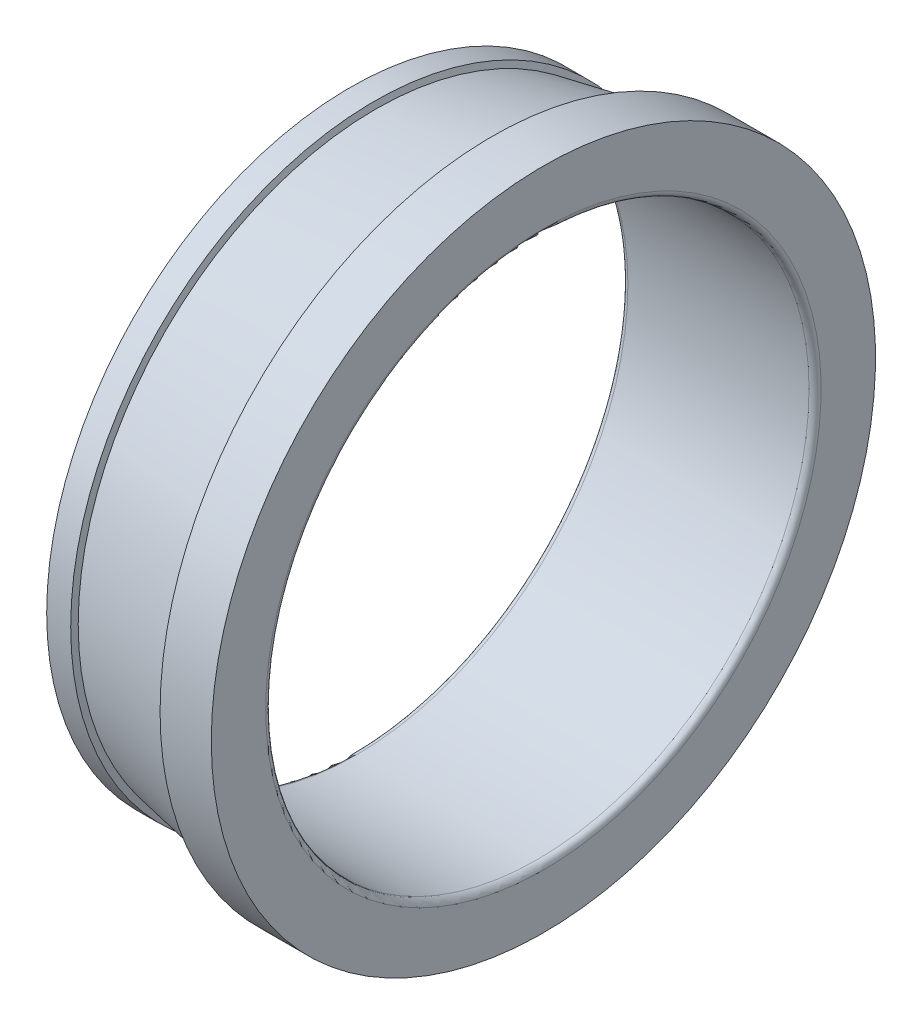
ISO-10303-21;
HEADER;
FILE_DESCRIPTION(('STEP AP214'),'2;1');
FILE_NAME('part.step','',(''),(''),'','','');
FILE_SCHEMA(('AUTOMOTIVE_DESIGN { 1 0 10303 214 1 1 1 1 }'));
ENDSEC;
DATA;
#1=APPLICATION_CONTEXT('core data for automotive mechanical design processes');
#2=APPLICATION_PROTOCOL_DEFINITION('international standard','automotive_design',2000,#1);
#3=PRODUCT_CONTEXT('',#1,'mechanical');
#4=PRODUCT('Part','Part','',(#3));
#5=PRODUCT_RELATED_PRODUCT_CATEGORY('part','',(#4));
#6=PRODUCT_DEFINITION_FORMATION('','',#4);
#7=PRODUCT_DEFINITION_CONTEXT('part definition',#1,'design');
#8=PRODUCT_DEFINITION('design','',#6,#7);
#9=PRODUCT_DEFINITION_SHAPE('','',#8);
#10=(LENGTH_UNIT() NAMED_UNIT(*) SI_UNIT(.MILLI.,.METRE.));
#11=(NAMED_UNIT(*) PLANE_ANGLE_UNIT() SI_UNIT($,.RADIAN.));
#12=(NAMED_UNIT(*) SI_UNIT($,.STERADIAN.) SOLID_ANGLE_UNIT());
#13=UNCERTAINTY_MEASURE_WITH_UNIT(LENGTH_MEASURE(1.E-05),#10,'distance_accuracy_value','');
#14=(GEOMETRIC_REPRESENTATION_CONTEXT(3) GLOBAL_UNCERTAINTY_ASSIGNED_CONTEXT((#13)) GLOBAL_UNIT_ASSIGNED_CONTEXT((#10,
#11,#12)) REPRESENTATION_CONTEXT('',''));
#15=CARTESIAN_POINT('',(0.,0.,0.));
#16=DIRECTION('',(0.,0.,1.));
#17=DIRECTION('',(1.,0.,0.));
#18=AXIS2_PLACEMENT_3D('',#15,#16,#17);
#19=CARTESIAN_POINT('',(1.,0.,0.));
#20=DIRECTION('',(-1.,0.,0.));
#21=DIRECTION('',(0.,0.,1.));
#22=AXIS2_PLACEMENT_3D('',#19,#20,#21);
#23=TOROIDAL_SURFACE('',#22,46.,1.);
#24=CARTESIAN_POINT('',(1.,0.,0.));
#25=DIRECTION('',(-1.,0.,0.));
#26=DIRECTION('',(0.,0.,1.));
#27=AXIS2_PLACEMENT_3D('',#24,#25,#26);
#28=CIRCLE('',#27,45.);
#29=CARTESIAN_POINT('',(1.,0.,45.));
#30=VERTEX_POINT('',#29);
#31=EDGE_CURVE('E10',#30,#30,#28,.T.);
#32=ORIENTED_EDGE('',*,*,#31,.F.);
#33=EDGE_LOOP('',(#32));
#34=FACE_BOUND('',#33,.T.);
#35=CARTESIAN_POINT('',(0.,0.,0.));
#36=DIRECTION('',(-1.,0.,0.));
#37=DIRECTION('',(0.,0.,1.));
#38=AXIS2_PLACEMENT_3D('',#35,#36,#37);
#39=CIRCLE('',#38,46.);
#40=CARTESIAN_POINT('',(0.,0.,46.));
#41=VERTEX_POINT('',#40);
#42=EDGE_CURVE('E63',#41,#41,#39,.T.);
#43=ORIENTED_EDGE('',*,*,#42,.T.);
#44=EDGE_LOOP('',(#43));
#45=FACE_BOUND('',#44,.T.);
#46=ADVANCED_FACE('F29',(#34,#45),#23,.T.);
#47=CARTESIAN_POINT('',(0.,0.,0.));
#48=DIRECTION('',(-1.,0.,0.));
#49=DIRECTION('',(0.,0.,1.));
#50=AXIS2_PLACEMENT_3D('',#47,#48,#49);
#51=CYLINDRICAL_SURFACE('',#50,45.);
#52=CARTESIAN_POINT('',(31.,0.,0.));
#53=DIRECTION('',(-1.,0.,0.));
#54=DIRECTION('',(0.,0.,1.));
#55=AXIS2_PLACEMENT_3D('',#52,#53,#54);
#56=CIRCLE('',#55,45.);
#57=CARTESIAN_POINT('',(31.,0.,45.));
#58=VERTEX_POINT('',#57);
#59=EDGE_CURVE('E35',#58,#58,#56,.T.);
#60=ORIENTED_EDGE('',*,*,#59,.F.);
#61=EDGE_LOOP('',(#60));
#62=FACE_BOUND('',#61,.T.);
#63=ORIENTED_EDGE('',*,*,#31,.T.);
#64=EDGE_LOOP('',(#63));
#65=FACE_BOUND('',#64,.T.);
#66=ADVANCED_FACE('F112',(#62,#65),#51,.F.);
#67=CARTESIAN_POINT('',(31.,0.,0.));
#68=DIRECTION('',(-1.,0.,0.));
#69=DIRECTION('',(0.,0.,1.));
#70=AXIS2_PLACEMENT_3D('',#67,#68,#69);
#71=TOROIDAL_SURFACE('',#70,46.,1.);
#72=CARTESIAN_POINT('',(32.,0.,0.));
#73=DIRECTION('',(-1.,0.,0.));
#74=DIRECTION('',(0.,0.,1.));
#75=AXIS2_PLACEMENT_3D('',#72,#73,#74);
#76=CIRCLE('',#75,46.);
#77=CARTESIAN_POINT('',(32.,0.,46.));
#78=VERTEX_POINT('',#77);
#79=EDGE_CURVE('E39',#78,#78,#76,.T.);
#80=ORIENTED_EDGE('',*,*,#79,.F.);
#81=EDGE_LOOP('',(#80));
#82=FACE_BOUND('',#81,.T.);
#83=ORIENTED_EDGE('',*,*,#59,.T.);
#84=EDGE_LOOP('',(#83));
#85=FACE_BOUND('',#84,.T.);
#86=ADVANCED_FACE('F107',(#82,#85),#71,.T.);
#87=CARTESIAN_POINT('',(32.,0.,-55.0152379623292));
#88=DIRECTION('',(-1.,0.,0.));
#89=DIRECTION('',(0.,0.,1.));
#90=AXIS2_PLACEMENT_3D('',#87,#88,#89);
#91=PLANE('',#90);
#92=CARTESIAN_POINT('',(32.,0.,0.));
#93=DIRECTION('',(-1.,0.,0.));
#94=DIRECTION('',(0.,0.,1.));
#95=AXIS2_PLACEMENT_3D('',#92,#93,#94);
#96=CIRCLE('',#95,55.0152379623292);
#97=CARTESIAN_POINT('',(32.,0.,55.0152379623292));
#98=VERTEX_POINT('',#97);
#99=EDGE_CURVE('E43',#98,#98,#96,.T.);
#100=ORIENTED_EDGE('',*,*,#99,.F.);
#101=EDGE_LOOP('',(#100));
#102=FACE_BOUND('',#101,.T.);
#103=ORIENTED_EDGE('',*,*,#79,.T.);
#104=EDGE_LOOP('',(#103));
#105=FACE_BOUND('',#104,.T.);
#106=ADVANCED_FACE('F101',(#102,#105),#91,.F.);
#107=CARTESIAN_POINT('',(0.,0.,0.));
#108=DIRECTION('',(-1.,0.,0.));
#109=DIRECTION('',(0.,0.,1.));
#110=AXIS2_PLACEMENT_3D('',#107,#108,#109);
#111=CYLINDRICAL_SURFACE('',#110,55.0152379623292);
#112=CARTESIAN_POINT('',(23.5130434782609,0.,0.));
#113=DIRECTION('',(-1.,0.,0.));
#114=DIRECTION('',(0.,0.,1.));
#115=AXIS2_PLACEMENT_3D('',#112,#113,#114);
#116=CIRCLE('',#115,55.0152379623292);
#117=CARTESIAN_POINT('',(23.5130434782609,0.,55.0152379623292));
#118=VERTEX_POINT('',#117);
#119=EDGE_CURVE('E48',#118,#118,#116,.T.);
#120=ORIENTED_EDGE('',*,*,#119,.F.);
#121=EDGE_LOOP('',(#120));
#122=FACE_BOUND('',#121,.T.);
#123=ORIENTED_EDGE('',*,*,#99,.T.);
#124=EDGE_LOOP('',(#123));
#125=FACE_BOUND('',#124,.T.);
#126=ADVANCED_FACE('F95',(#122,#125),#111,.T.);
#127=CARTESIAN_POINT('',(23.5130434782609,0.,0.));
#128=DIRECTION('',(-1.,0.,0.));
#129=DIRECTION('',(0.,0.,1.));
#130=AXIS2_PLACEMENT_3D('',#127,#128,#129);
#131=CONICAL_SURFACE('',#130,55.0152379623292,1.33196512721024);
#132=CARTESIAN_POINT('',(24.,0.,0.));
#133=DIRECTION('',(-1.,0.,0.));
#134=DIRECTION('',(0.,0.,1.));
#135=AXIS2_PLACEMENT_3D('',#132,#133,#134);
#136=CIRCLE('',#135,53.0152379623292);
#137=CARTESIAN_POINT('',(24.,0.,53.0152379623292));
#138=VERTEX_POINT('',#137);
#139=EDGE_CURVE('E51',#138,#138,#136,.T.);
#140=ORIENTED_EDGE('',*,*,#139,.F.);
#141=EDGE_LOOP('',(#140));
#142=FACE_BOUND('',#141,.T.);
#143=ORIENTED_EDGE('',*,*,#119,.T.);
#144=EDGE_LOOP('',(#143));
#145=FACE_BOUND('',#144,.T.);
#146=ADVANCED_FACE('F89',(#142,#145),#131,.F.);
#147=CARTESIAN_POINT('',(24.,0.,0.));
#148=DIRECTION('',(1.,0.,0.));
#149=DIRECTION('',(0.,0.,-1.));
#150=AXIS2_PLACEMENT_3D('',#147,#148,#149);
#151=CONICAL_SURFACE('',#150,53.0152379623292,0.186471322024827);
#152=CARTESIAN_POINT('',(4.22482411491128,0.,0.));
#153=DIRECTION('',(-1.,0.,0.));
#154=DIRECTION('',(0.,0.,1.));
#155=AXIS2_PLACEMENT_3D('',#152,#153,#154);
#156=CIRCLE('',#155,49.2843917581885);
#157=CARTESIAN_POINT('',(4.22482411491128,0.,49.2843917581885));
#158=VERTEX_POINT('',#157);
#159=EDGE_CURVE('E54',#158,#158,#156,.T.);
#160=ORIENTED_EDGE('',*,*,#159,.F.);
#161=EDGE_LOOP('',(#160));
#162=FACE_BOUND('',#161,.T.);
#163=ORIENTED_EDGE('',*,*,#139,.T.);
#164=EDGE_LOOP('',(#163));
#165=FACE_BOUND('',#164,.T.);
#166=ADVANCED_FACE('F83',(#162,#165),#151,.T.);
#167=CARTESIAN_POINT('',(4.22482411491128,0.,0.));
#168=DIRECTION('',(-1.,0.,0.));
#169=DIRECTION('',(0.,0.,1.));
#170=AXIS2_PLACEMENT_3D('',#167,#168,#169);
#171=CONICAL_SURFACE('',#170,49.2843917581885,1.33196512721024);
#172=CARTESIAN_POINT('',(3.98134585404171,0.,0.));
#173=DIRECTION('',(-1.,0.,0.));
#174=DIRECTION('',(0.,0.,1.));
#175=AXIS2_PLACEMENT_3D('',#172,#173,#174);
#176=CIRCLE('',#175,50.2843917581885);
#177=CARTESIAN_POINT('',(3.98134585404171,0.,50.2843917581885));
#178=VERTEX_POINT('',#177);
#179=EDGE_CURVE('E57',#178,#178,#176,.T.);
#180=ORIENTED_EDGE('',*,*,#179,.F.);
#181=EDGE_LOOP('',(#180));
#182=FACE_BOUND('',#181,.T.);
#183=ORIENTED_EDGE('',*,*,#159,.T.);
#184=EDGE_LOOP('',(#183));
#185=FACE_BOUND('',#184,.T.);
#186=ADVANCED_FACE('F77',(#182,#185),#171,.T.);
#187=CARTESIAN_POINT('',(0.,0.,0.));
#188=DIRECTION('',(-1.,0.,0.));
#189=DIRECTION('',(0.,0.,1.));
#190=AXIS2_PLACEMENT_3D('',#187,#188,#189);
#191=CYLINDRICAL_SURFACE('',#190,50.2843917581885);
#192=CARTESIAN_POINT('',(0.,0.,0.));
#193=DIRECTION('',(-1.,0.,0.));
#194=DIRECTION('',(0.,0.,1.));
#195=AXIS2_PLACEMENT_3D('',#192,#193,#194);
#196=CIRCLE('',#195,50.2843917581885);
#197=CARTESIAN_POINT('',(0.,0.,50.2843917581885));
#198=VERTEX_POINT('',#197);
#199=EDGE_CURVE('E60',#198,#198,#196,.T.);
#200=ORIENTED_EDGE('',*,*,#199,.F.);
#201=EDGE_LOOP('',(#200));
#202=FACE_BOUND('',#201,.T.);
#203=ORIENTED_EDGE('',*,*,#179,.T.);
#204=EDGE_LOOP('',(#203));
#205=FACE_BOUND('',#204,.T.);
#206=ADVANCED_FACE('F71',(#202,#205),#191,.T.);
#207=CARTESIAN_POINT('',(0.,0.,-46.));
#208=DIRECTION('',(1.,0.,0.));
#209=DIRECTION('',(0.,0.,-1.));
#210=AXIS2_PLACEMENT_3D('',#207,#208,#209);
#211=PLANE('',#210);
#212=ORIENTED_EDGE('',*,*,#42,.F.);
#213=EDGE_LOOP('',(#212));
#214=FACE_BOUND('',#213,.T.);
#215=ORIENTED_EDGE('',*,*,#199,.T.);
#216=EDGE_LOOP('',(#215));
#217=FACE_BOUND('',#216,.T.);
#218=ADVANCED_FACE('F68',(#214,#217),#211,.F.);
#219=CLOSED_SHELL('',(#46,#66,#86,#106,#126,#146,#166,#186,#206,#218));
#220=MANIFOLD_SOLID_BREP('B2',#219);
#221=ADVANCED_BREP_SHAPE_REPRESENTATION('',(#18,#220),#14);
#222=SHAPE_DEFINITION_REPRESENTATION(#9,#221);
ENDSEC;
END-ISO-10303-21;
